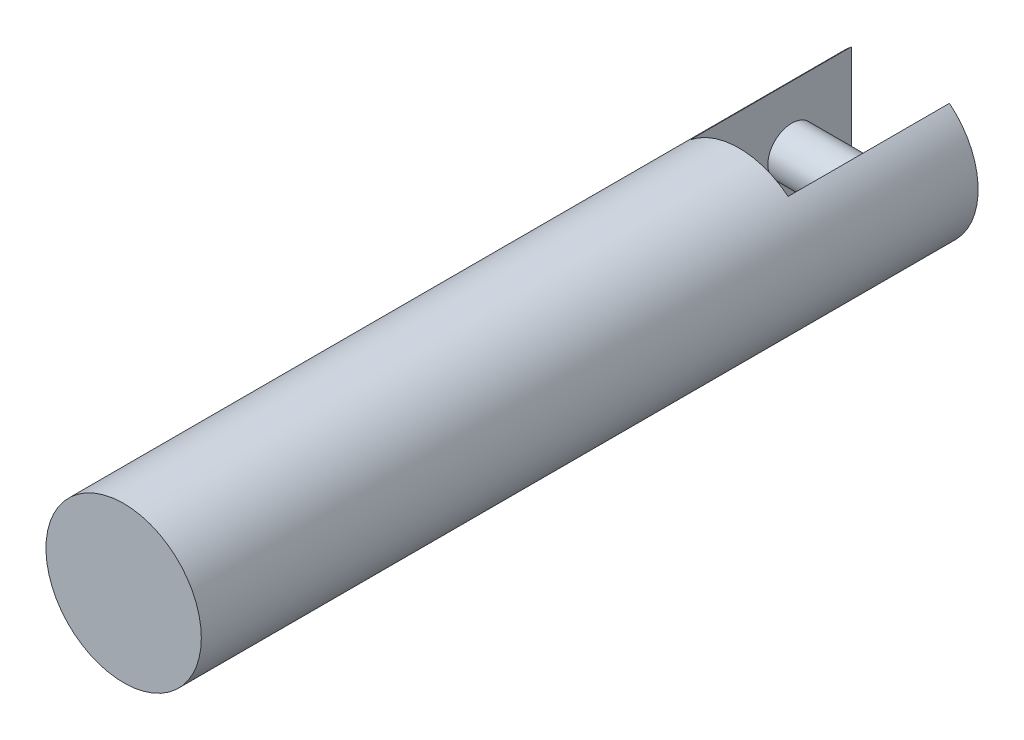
ISO-10303-21;
HEADER;
FILE_DESCRIPTION(('STEP AP214'),'2;1');
FILE_NAME('part.step','',(''),(''),'','','');
FILE_SCHEMA(('AUTOMOTIVE_DESIGN { 1 0 10303 214 1 1 1 1 }'));
ENDSEC;
DATA;
#1=APPLICATION_CONTEXT('core data for automotive mechanical design processes');
#2=APPLICATION_PROTOCOL_DEFINITION('international standard','automotive_design',2000,#1);
#3=PRODUCT_CONTEXT('',#1,'mechanical');
#4=PRODUCT('Part','Part','',(#3));
#5=PRODUCT_RELATED_PRODUCT_CATEGORY('part','',(#4));
#6=PRODUCT_DEFINITION_FORMATION('','',#4);
#7=PRODUCT_DEFINITION_CONTEXT('part definition',#1,'design');
#8=PRODUCT_DEFINITION('design','',#6,#7);
#9=PRODUCT_DEFINITION_SHAPE('','',#8);
#10=(LENGTH_UNIT() NAMED_UNIT(*) SI_UNIT(.MILLI.,.METRE.));
#11=(NAMED_UNIT(*) PLANE_ANGLE_UNIT() SI_UNIT($,.RADIAN.));
#12=(NAMED_UNIT(*) SI_UNIT($,.STERADIAN.) SOLID_ANGLE_UNIT());
#13=UNCERTAINTY_MEASURE_WITH_UNIT(LENGTH_MEASURE(1.E-05),#10,'distance_accuracy_value','');
#14=(GEOMETRIC_REPRESENTATION_CONTEXT(3) GLOBAL_UNCERTAINTY_ASSIGNED_CONTEXT((#13)) GLOBAL_UNIT_ASSIGNED_CONTEXT((#10,
#11,#12)) REPRESENTATION_CONTEXT('',''));
#15=CARTESIAN_POINT('',(0.,0.,0.));
#16=DIRECTION('',(0.,0.,1.));
#17=DIRECTION('',(1.,0.,0.));
#18=AXIS2_PLACEMENT_3D('',#15,#16,#17);
#19=CARTESIAN_POINT('',(-4.1,-10.,-5.));
#20=DIRECTION('',(-1.,0.,0.));
#21=DIRECTION('',(0.,0.,1.));
#22=AXIS2_PLACEMENT_3D('',#19,#20,#21);
#23=PLANE('',#22);
#24=DIRECTION('',(0.,1.,0.));
#25=VECTOR('',#24,1.);
#26=CARTESIAN_POINT('',(-4.1,-10.,8.5));
#27=LINE('',#26,#25);
#28=CARTESIAN_POINT('',(-4.1,-5.04380808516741,8.5));
#29=VERTEX_POINT('',#28);
#30=CARTESIAN_POINT('',(-4.1,5.04380808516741,8.5));
#31=VERTEX_POINT('',#30);
#32=EDGE_CURVE('E73',#29,#31,#27,.T.);
#33=ORIENTED_EDGE('',*,*,#32,.F.);
#34=DIRECTION('',(0.,0.,-1.));
#35=VECTOR('',#34,1.);
#36=CARTESIAN_POINT('',(-4.1,-5.04380808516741,60.));
#37=LINE('',#36,#35);
#38=CARTESIAN_POINT('',(-4.1,-5.0438080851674,-5.));
#39=VERTEX_POINT('',#38);
#40=EDGE_CURVE('E66',#39,#29,#37,.F.);
#41=ORIENTED_EDGE('',*,*,#40,.F.);
#42=DIRECTION('',(0.,-1.,0.));
#43=VECTOR('',#42,1.);
#44=CARTESIAN_POINT('',(-4.1,0.,-5.));
#45=LINE('',#44,#43);
#46=CARTESIAN_POINT('',(-4.1,5.0438080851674,-5.));
#47=VERTEX_POINT('',#46);
#48=EDGE_CURVE('E78',#47,#39,#45,.T.);
#49=ORIENTED_EDGE('',*,*,#48,.F.);
#50=DIRECTION('',(0.,0.,-1.));
#51=VECTOR('',#50,1.);
#52=CARTESIAN_POINT('',(-4.1,5.04380808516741,60.));
#53=LINE('',#52,#51);
#54=EDGE_CURVE('E38',#31,#47,#53,.T.);
#55=ORIENTED_EDGE('',*,*,#54,.F.);
#56=EDGE_LOOP('',(#33,#41,#49,#55));
#57=FACE_BOUND('',#56,.T.);
#58=CARTESIAN_POINT('',(-4.1,0.,0.));
#59=DIRECTION('',(-1.,0.,0.));
#60=DIRECTION('',(0.,0.,1.));
#61=AXIS2_PLACEMENT_3D('',#58,#59,#60);
#62=CIRCLE('',#61,2.);
#63=CARTESIAN_POINT('',(-4.1,0.,2.));
#64=VERTEX_POINT('',#63);
#65=EDGE_CURVE('E9',#64,#64,#62,.F.);
#66=ORIENTED_EDGE('',*,*,#65,.F.);
#67=EDGE_LOOP('',(#66));
#68=FACE_BOUND('',#67,.T.);
#69=ADVANCED_FACE('F14',(#57,#68),#23,.F.);
#70=CARTESIAN_POINT('',(4.1,-10.,-5.));
#71=DIRECTION('',(1.,0.,0.));
#72=DIRECTION('',(0.,0.,-1.));
#73=AXIS2_PLACEMENT_3D('',#70,#71,#72);
#74=PLANE('',#73);
#75=DIRECTION('',(0.,1.,0.));
#76=VECTOR('',#75,1.);
#77=CARTESIAN_POINT('',(4.1,-10.,8.5));
#78=LINE('',#77,#76);
#79=CARTESIAN_POINT('',(4.1,-5.04380808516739,8.5));
#80=VERTEX_POINT('',#79);
#81=CARTESIAN_POINT('',(4.1,5.04380808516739,8.5));
#82=VERTEX_POINT('',#81);
#83=EDGE_CURVE('E60',#80,#82,#78,.T.);
#84=ORIENTED_EDGE('',*,*,#83,.T.);
#85=DIRECTION('',(0.,0.,-1.));
#86=VECTOR('',#85,1.);
#87=CARTESIAN_POINT('',(4.1,5.04380808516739,60.));
#88=LINE('',#87,#86);
#89=CARTESIAN_POINT('',(4.1,5.0438080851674,-5.));
#90=VERTEX_POINT('',#89);
#91=EDGE_CURVE('E30',#90,#82,#88,.F.);
#92=ORIENTED_EDGE('',*,*,#91,.F.);
#93=DIRECTION('',(0.,1.,0.));
#94=VECTOR('',#93,1.);
#95=CARTESIAN_POINT('',(4.1,0.,-5.));
#96=LINE('',#95,#94);
#97=CARTESIAN_POINT('',(4.1,-5.0438080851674,-5.));
#98=VERTEX_POINT('',#97);
#99=EDGE_CURVE('E61',#98,#90,#96,.T.);
#100=ORIENTED_EDGE('',*,*,#99,.F.);
#101=DIRECTION('',(0.,0.,-1.));
#102=VECTOR('',#101,1.);
#103=CARTESIAN_POINT('',(4.1,-5.04380808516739,60.));
#104=LINE('',#103,#102);
#105=EDGE_CURVE('E56',#80,#98,#104,.T.);
#106=ORIENTED_EDGE('',*,*,#105,.F.);
#107=EDGE_LOOP('',(#84,#92,#100,#106));
#108=FACE_BOUND('',#107,.T.);
#109=CARTESIAN_POINT('',(4.1,0.,0.));
#110=DIRECTION('',(1.,0.,0.));
#111=DIRECTION('',(0.,0.,-1.));
#112=AXIS2_PLACEMENT_3D('',#109,#110,#111);
#113=CIRCLE('',#112,2.);
#114=CARTESIAN_POINT('',(4.1,0.,-2.));
#115=VERTEX_POINT('',#114);
#116=EDGE_CURVE('E18',#115,#115,#113,.F.);
#117=ORIENTED_EDGE('',*,*,#116,.F.);
#118=EDGE_LOOP('',(#117));
#119=FACE_BOUND('',#118,.T.);
#120=ADVANCED_FACE('F58',(#108,#119),#74,.F.);
#121=CARTESIAN_POINT('',(0.,0.,-5.));
#122=DIRECTION('',(0.,0.,1.));
#123=DIRECTION('',(1.,0.,0.));
#124=AXIS2_PLACEMENT_3D('',#121,#122,#123);
#125=PLANE('',#124);
#126=CARTESIAN_POINT('',(0.,0.,-5.));
#127=DIRECTION('',(0.,0.,1.));
#128=DIRECTION('',(1.,0.,0.));
#129=AXIS2_PLACEMENT_3D('',#126,#127,#128);
#130=CIRCLE('',#129,6.5);
#131=EDGE_CURVE('E86',#47,#39,#130,.T.);
#132=ORIENTED_EDGE('',*,*,#131,.F.);
#133=ORIENTED_EDGE('',*,*,#48,.T.);
#134=EDGE_LOOP('',(#132,#133));
#135=FACE_BOUND('',#134,.T.);
#136=ADVANCED_FACE('F98',(#135),#125,.F.);
#137=CARTESIAN_POINT('',(0.,0.,60.));
#138=DIRECTION('',(0.,0.,-1.));
#139=DIRECTION('',(-1.,0.,0.));
#140=AXIS2_PLACEMENT_3D('',#137,#138,#139);
#141=CYLINDRICAL_SURFACE('',#140,6.5);
#142=CARTESIAN_POINT('',(0.,0.,60.));
#143=DIRECTION('',(0.,0.,1.));
#144=DIRECTION('',(1.,0.,0.));
#145=AXIS2_PLACEMENT_3D('',#142,#143,#144);
#146=CIRCLE('',#145,6.5);
#147=CARTESIAN_POINT('',(6.5,0.,60.));
#148=VERTEX_POINT('',#147);
#149=EDGE_CURVE('E83',#148,#148,#146,.T.);
#150=ORIENTED_EDGE('',*,*,#149,.F.);
#151=EDGE_LOOP('',(#150));
#152=FACE_BOUND('',#151,.T.);
#153=ORIENTED_EDGE('',*,*,#131,.T.);
#154=ORIENTED_EDGE('',*,*,#40,.T.);
#155=CARTESIAN_POINT('',(0.,0.,8.5));
#156=DIRECTION('',(0.,0.,1.));
#157=DIRECTION('',(1.,0.,0.));
#158=AXIS2_PLACEMENT_3D('',#155,#156,#157);
#159=CIRCLE('',#158,6.5);
#160=EDGE_CURVE('E70',#29,#80,#159,.T.);
#161=ORIENTED_EDGE('',*,*,#160,.T.);
#162=ORIENTED_EDGE('',*,*,#105,.T.);
#163=EDGE_CURVE('E87',#98,#90,#130,.T.);
#164=ORIENTED_EDGE('',*,*,#163,.T.);
#165=ORIENTED_EDGE('',*,*,#91,.T.);
#166=EDGE_CURVE('E72',#82,#31,#159,.T.);
#167=ORIENTED_EDGE('',*,*,#166,.T.);
#168=ORIENTED_EDGE('',*,*,#54,.T.);
#169=EDGE_LOOP('',(#153,#154,#161,#162,#164,#165,#167,#168));
#170=FACE_BOUND('',#169,.T.);
#171=ADVANCED_FACE('F16',(#152,#170),#141,.T.);
#172=CARTESIAN_POINT('',(0.,0.,60.));
#173=DIRECTION('',(0.,0.,1.));
#174=DIRECTION('',(1.,0.,0.));
#175=AXIS2_PLACEMENT_3D('',#172,#173,#174);
#176=PLANE('',#175);
#177=ORIENTED_EDGE('',*,*,#149,.T.);
#178=EDGE_LOOP('',(#177));
#179=FACE_BOUND('',#178,.T.);
#180=ADVANCED_FACE('F96',(#179),#176,.T.);
#181=ORIENTED_EDGE('',*,*,#163,.F.);
#182=ORIENTED_EDGE('',*,*,#99,.T.);
#183=EDGE_LOOP('',(#181,#182));
#184=FACE_BOUND('',#183,.T.);
#185=ADVANCED_FACE('F94',(#184),#125,.F.);
#186=CARTESIAN_POINT('',(4.1,-10.,8.5));
#187=DIRECTION('',(0.,0.,1.));
#188=DIRECTION('',(1.,0.,0.));
#189=AXIS2_PLACEMENT_3D('',#186,#187,#188);
#190=PLANE('',#189);
#191=ORIENTED_EDGE('',*,*,#83,.F.);
#192=ORIENTED_EDGE('',*,*,#160,.F.);
#193=ORIENTED_EDGE('',*,*,#32,.T.);
#194=ORIENTED_EDGE('',*,*,#166,.F.);
#195=EDGE_LOOP('',(#191,#192,#193,#194));
#196=FACE_BOUND('',#195,.T.);
#197=ADVANCED_FACE('F69',(#196),#190,.F.);
#198=CARTESIAN_POINT('',(-5.,0.,0.));
#199=DIRECTION('',(1.,0.,0.));
#200=DIRECTION('',(0.,0.,-1.));
#201=AXIS2_PLACEMENT_3D('',#198,#199,#200);
#202=CYLINDRICAL_SURFACE('',#201,2.);
#203=ORIENTED_EDGE('',*,*,#116,.T.);
#204=EDGE_LOOP('',(#203));
#205=FACE_BOUND('',#204,.T.);
#206=ORIENTED_EDGE('',*,*,#65,.T.);
#207=EDGE_LOOP('',(#206));
#208=FACE_BOUND('',#207,.T.);
#209=ADVANCED_FACE('F105',(#205,#208),#202,.T.);
#210=CLOSED_SHELL('',(#69,#120,#136,#171,#180,#185,#197,#209));
#211=MANIFOLD_SOLID_BREP('B1',#210);
#212=ADVANCED_BREP_SHAPE_REPRESENTATION('',(#18,#211),#14);
#213=SHAPE_DEFINITION_REPRESENTATION(#9,#212);
ENDSEC;
END-ISO-10303-21;
